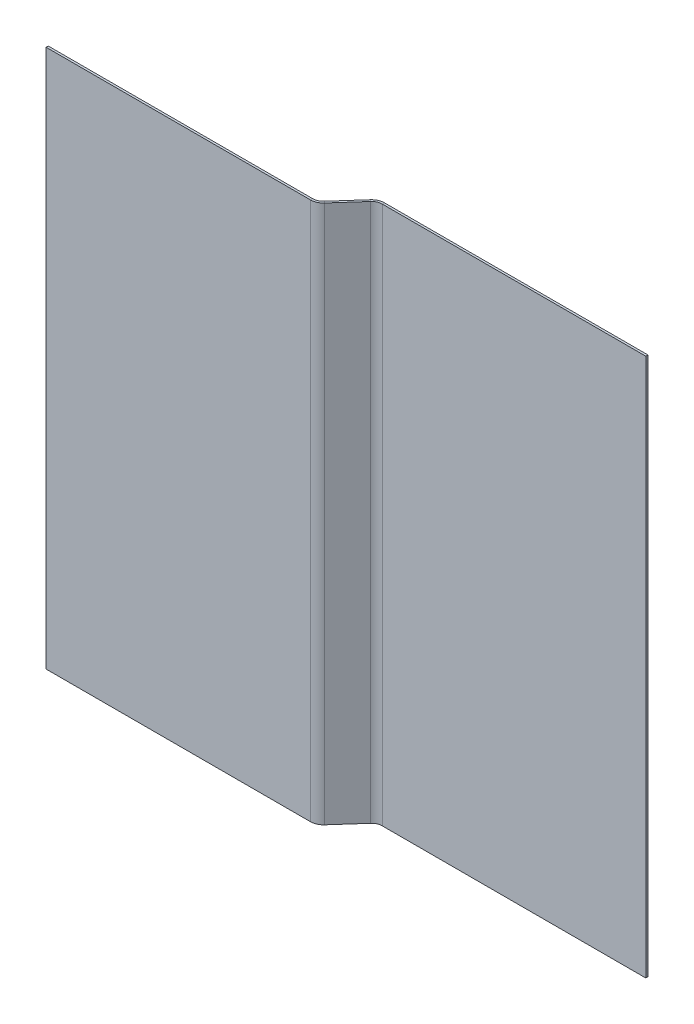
ISO-10303-21;
HEADER;
FILE_DESCRIPTION(('STEP AP214'),'2;1');
FILE_NAME('part.step','',(''),(''),'','','');
FILE_SCHEMA(('AUTOMOTIVE_DESIGN { 1 0 10303 214 1 1 1 1 }'));
ENDSEC;
DATA;
#1=APPLICATION_CONTEXT('core data for automotive mechanical design processes');
#2=APPLICATION_PROTOCOL_DEFINITION('international standard','automotive_design',2000,#1);
#3=PRODUCT_CONTEXT('',#1,'mechanical');
#4=PRODUCT('Part','Part','',(#3));
#5=PRODUCT_RELATED_PRODUCT_CATEGORY('part','',(#4));
#6=PRODUCT_DEFINITION_FORMATION('','',#4);
#7=PRODUCT_DEFINITION_CONTEXT('part definition',#1,'design');
#8=PRODUCT_DEFINITION('design','',#6,#7);
#9=PRODUCT_DEFINITION_SHAPE('','',#8);
#10=(LENGTH_UNIT() NAMED_UNIT(*) SI_UNIT(.MILLI.,.METRE.));
#11=(NAMED_UNIT(*) PLANE_ANGLE_UNIT() SI_UNIT($,.RADIAN.));
#12=(NAMED_UNIT(*) SI_UNIT($,.STERADIAN.) SOLID_ANGLE_UNIT());
#13=UNCERTAINTY_MEASURE_WITH_UNIT(LENGTH_MEASURE(1.E-05),#10,'distance_accuracy_value','');
#14=(GEOMETRIC_REPRESENTATION_CONTEXT(3) GLOBAL_UNCERTAINTY_ASSIGNED_CONTEXT((#13)) GLOBAL_UNIT_ASSIGNED_CONTEXT((#10,
#11,#12)) REPRESENTATION_CONTEXT('',''));
#15=CARTESIAN_POINT('',(0.,0.,0.));
#16=DIRECTION('',(0.,0.,1.));
#17=DIRECTION('',(1.,0.,0.));
#18=AXIS2_PLACEMENT_3D('',#15,#16,#17);
#19=CARTESIAN_POINT('',(-23.7645171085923,500.,-3.34520515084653));
#20=DIRECTION('',(0.,1.,0.));
#21=DIRECTION('',(0.,0.,1.));
#22=AXIS2_PLACEMENT_3D('',#19,#20,#21);
#23=PLANE('',#22);
#24=DIRECTION('',(0.746416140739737,0.,0.665479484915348));
#25=VECTOR('',#24,1.);
#26=CARTESIAN_POINT('',(-23.7645171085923,500.,-3.34520515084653));
#27=LINE('',#26,#25);
#28=CARTESIAN_POINT('',(-23.7645171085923,500.,-3.34520515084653));
#29=VERTEX_POINT('',#28);
#30=CARTESIAN_POINT('',(-22.2716848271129,500.,-2.01424618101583));
#31=VERTEX_POINT('',#30);
#32=EDGE_CURVE('E11',#29,#31,#27,.T.);
#33=ORIENTED_EDGE('',*,*,#32,.F.);
#34=CARTESIAN_POINT('',(-31.2286785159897,500.,-10.));
#35=DIRECTION('',(0.,-1.,0.));
#36=DIRECTION('',(0.,0.,-1.));
#37=AXIS2_PLACEMENT_3D('',#34,#35,#36);
#38=CIRCLE('',#37,10.);
#39=CARTESIAN_POINT('',(-31.2286785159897,500.,0.));
#40=VERTEX_POINT('',#39);
#41=EDGE_CURVE('E243',#40,#29,#38,.F.);
#42=ORIENTED_EDGE('',*,*,#41,.F.);
#43=DIRECTION('',(0.,0.,-1.));
#44=VECTOR('',#43,1.);
#45=CARTESIAN_POINT('',(-31.2286785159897,500.,1.99999999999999));
#46=LINE('',#45,#44);
#47=CARTESIAN_POINT('',(-31.2286785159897,500.,1.99999999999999));
#48=VERTEX_POINT('',#47);
#49=EDGE_CURVE('E41',#48,#40,#46,.T.);
#50=ORIENTED_EDGE('',*,*,#49,.F.);
#51=CARTESIAN_POINT('',(-31.2286785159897,500.,-10.));
#52=DIRECTION('',(0.,1.,0.));
#53=DIRECTION('',(1.,0.,0.));
#54=AXIS2_PLACEMENT_3D('',#51,#52,#53);
#55=CIRCLE('',#54,12.);
#56=EDGE_CURVE('E142',#48,#31,#55,.T.);
#57=ORIENTED_EDGE('',*,*,#56,.T.);
#58=EDGE_LOOP('',(#33,#42,#50,#57));
#59=FACE_BOUND('',#58,.T.);
#60=ADVANCED_FACE('F33',(#59),#23,.T.);
#61=CARTESIAN_POINT('',(-31.2286785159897,500.,1.99999999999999));
#62=DIRECTION('',(0.,1.,0.));
#63=DIRECTION('',(0.,0.,1.));
#64=AXIS2_PLACEMENT_3D('',#61,#62,#63);
#65=PLANE('',#64);
#66=DIRECTION('',(0.665479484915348,0.,-0.746416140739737));
#67=VECTOR('',#66,1.);
#68=CARTESIAN_POINT('',(-26.7469893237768,500.,0.));
#69=LINE('',#68,#67);
#70=CARTESIAN_POINT('',(-3.57896665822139,500.,-25.9857538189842));
#71=VERTEX_POINT('',#70);
#72=EDGE_CURVE('E136',#29,#71,#69,.T.);
#73=ORIENTED_EDGE('',*,*,#72,.F.);
#74=ORIENTED_EDGE('',*,*,#32,.T.);
#75=DIRECTION('',(0.665479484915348,0.,-0.746416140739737));
#76=VECTOR('',#75,1.);
#77=CARTESIAN_POINT('',(-25.2541570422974,500.,1.3309589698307));
#78=LINE('',#77,#76);
#79=CARTESIAN_POINT('',(-2.08613437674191,500.,-24.6547948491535));
#80=VERTEX_POINT('',#79);
#81=EDGE_CURVE('E133',#31,#80,#78,.T.);
#82=ORIENTED_EDGE('',*,*,#81,.T.);
#83=DIRECTION('',(-0.746416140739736,0.,-0.66547948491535));
#84=VECTOR('',#83,1.);
#85=CARTESIAN_POINT('',(-2.08613437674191,500.,-24.6547948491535));
#86=LINE('',#85,#84);
#87=EDGE_CURVE('E224',#80,#71,#86,.T.);
#88=ORIENTED_EDGE('',*,*,#87,.T.);
#89=EDGE_LOOP('',(#73,#74,#82,#88));
#90=FACE_BOUND('',#89,.T.);
#91=ADVANCED_FACE('F131',(#90),#65,.T.);
#92=CARTESIAN_POINT('',(-31.2286785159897,0.,0.));
#93=DIRECTION('',(0.,-1.,0.));
#94=DIRECTION('',(0.,0.,-1.));
#95=AXIS2_PLACEMENT_3D('',#92,#93,#94);
#96=PLANE('',#95);
#97=DIRECTION('',(0.,0.,1.));
#98=VECTOR('',#97,1.);
#99=CARTESIAN_POINT('',(-31.2286785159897,0.,0.));
#100=LINE('',#99,#98);
#101=CARTESIAN_POINT('',(-31.2286785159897,0.,0.));
#102=VERTEX_POINT('',#101);
#103=CARTESIAN_POINT('',(-31.2286785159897,0.,1.99999999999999));
#104=VERTEX_POINT('',#103);
#105=EDGE_CURVE('E229',#102,#104,#100,.T.);
#106=ORIENTED_EDGE('',*,*,#105,.F.);
#107=CARTESIAN_POINT('',(-31.2286785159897,0.,-10.));
#108=DIRECTION('',(0.,-1.,0.));
#109=DIRECTION('',(0.,0.,-1.));
#110=AXIS2_PLACEMENT_3D('',#107,#108,#109);
#111=CIRCLE('',#110,10.);
#112=CARTESIAN_POINT('',(-23.7645171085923,0.,-3.34520515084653));
#113=VERTEX_POINT('',#112);
#114=EDGE_CURVE('E181',#102,#113,#111,.F.);
#115=ORIENTED_EDGE('',*,*,#114,.T.);
#116=DIRECTION('',(-0.746416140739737,0.,-0.665479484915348));
#117=VECTOR('',#116,1.);
#118=CARTESIAN_POINT('',(-22.2716848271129,0.,-2.01424618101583));
#119=LINE('',#118,#117);
#120=CARTESIAN_POINT('',(-22.2716848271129,0.,-2.01424618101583));
#121=VERTEX_POINT('',#120);
#122=EDGE_CURVE('E227',#121,#113,#119,.T.);
#123=ORIENTED_EDGE('',*,*,#122,.F.);
#124=CARTESIAN_POINT('',(-31.2286785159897,0.,-10.));
#125=DIRECTION('',(0.,1.,0.));
#126=DIRECTION('',(1.,0.,0.));
#127=AXIS2_PLACEMENT_3D('',#124,#125,#126);
#128=CIRCLE('',#127,12.);
#129=EDGE_CURVE('E154',#104,#121,#128,.T.);
#130=ORIENTED_EDGE('',*,*,#129,.F.);
#131=EDGE_LOOP('',(#106,#115,#123,#130));
#132=FACE_BOUND('',#131,.T.);
#133=ADVANCED_FACE('F281',(#132),#96,.T.);
#134=CARTESIAN_POINT('',(-22.2716848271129,0.,-2.01424618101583));
#135=DIRECTION('',(0.,-1.,0.));
#136=DIRECTION('',(0.,0.,-1.));
#137=AXIS2_PLACEMENT_3D('',#134,#135,#136);
#138=PLANE('',#137);
#139=DIRECTION('',(1.,0.,0.));
#140=VECTOR('',#139,1.);
#141=CARTESIAN_POINT('',(-276.746989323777,0.,0.));
#142=LINE('',#141,#140);
#143=CARTESIAN_POINT('',(-276.746989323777,0.,0.));
#144=VERTEX_POINT('',#143);
#145=EDGE_CURVE('E184',#144,#102,#142,.T.);
#146=ORIENTED_EDGE('',*,*,#145,.T.);
#147=ORIENTED_EDGE('',*,*,#105,.T.);
#148=DIRECTION('',(1.,0.,0.));
#149=VECTOR('',#148,1.);
#150=CARTESIAN_POINT('',(-276.746989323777,0.,2.));
#151=LINE('',#150,#149);
#152=CARTESIAN_POINT('',(-276.746989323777,0.,2.));
#153=VERTEX_POINT('',#152);
#154=EDGE_CURVE('E190',#153,#104,#151,.T.);
#155=ORIENTED_EDGE('',*,*,#154,.F.);
#156=DIRECTION('',(0.,0.,-1.));
#157=VECTOR('',#156,1.);
#158=CARTESIAN_POINT('',(-276.746989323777,0.,2.));
#159=LINE('',#158,#157);
#160=EDGE_CURVE('E187',#153,#144,#159,.T.);
#161=ORIENTED_EDGE('',*,*,#160,.T.);
#162=EDGE_LOOP('',(#146,#147,#155,#161));
#163=FACE_BOUND('',#162,.T.);
#164=ADVANCED_FACE('F284',(#163),#138,.T.);
#165=CARTESIAN_POINT('',(5.37802703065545,500.,-30.));
#166=DIRECTION('',(0.,1.,0.));
#167=DIRECTION('',(0.,0.,1.));
#168=AXIS2_PLACEMENT_3D('',#165,#166,#167);
#169=PLANE('',#168);
#170=DIRECTION('',(0.,0.,1.));
#171=VECTOR('',#170,1.);
#172=CARTESIAN_POINT('',(5.37802703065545,500.,-30.));
#173=LINE('',#172,#171);
#174=CARTESIAN_POINT('',(5.37802703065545,500.,-30.));
#175=VERTEX_POINT('',#174);
#176=CARTESIAN_POINT('',(5.37802703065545,500.,-28.));
#177=VERTEX_POINT('',#176);
#178=EDGE_CURVE('E49',#175,#177,#173,.T.);
#179=ORIENTED_EDGE('',*,*,#178,.F.);
#180=CARTESIAN_POINT('',(5.37802703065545,500.,-18.));
#181=DIRECTION('',(0.,1.,0.));
#182=DIRECTION('',(0.,0.,1.));
#183=AXIS2_PLACEMENT_3D('',#180,#181,#182);
#184=CIRCLE('',#183,12.);
#185=EDGE_CURVE('E253',#71,#175,#184,.F.);
#186=ORIENTED_EDGE('',*,*,#185,.F.);
#187=ORIENTED_EDGE('',*,*,#87,.F.);
#188=CARTESIAN_POINT('',(5.37802703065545,500.,-18.));
#189=DIRECTION('',(0.,1.,0.));
#190=DIRECTION('',(1.,0.,0.));
#191=AXIS2_PLACEMENT_3D('',#188,#189,#190);
#192=CIRCLE('',#191,10.);
#193=EDGE_CURVE('E162',#80,#177,#192,.F.);
#194=ORIENTED_EDGE('',*,*,#193,.T.);
#195=EDGE_LOOP('',(#179,#186,#187,#194));
#196=FACE_BOUND('',#195,.T.);
#197=ADVANCED_FACE('F276',(#196),#169,.T.);
#198=CARTESIAN_POINT('',(-2.08613437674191,500.,-24.6547948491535));
#199=DIRECTION('',(0.,1.,0.));
#200=DIRECTION('',(0.,0.,1.));
#201=AXIS2_PLACEMENT_3D('',#198,#199,#200);
#202=PLANE('',#201);
#203=DIRECTION('',(1.,0.,0.));
#204=VECTOR('',#203,1.);
#205=CARTESIAN_POINT('',(0.,500.,-30.));
#206=LINE('',#205,#204);
#207=CARTESIAN_POINT('',(250.,500.,-30.));
#208=VERTEX_POINT('',#207);
#209=EDGE_CURVE('E256',#175,#208,#206,.T.);
#210=ORIENTED_EDGE('',*,*,#209,.F.);
#211=ORIENTED_EDGE('',*,*,#178,.T.);
#212=DIRECTION('',(1.,0.,0.));
#213=VECTOR('',#212,1.);
#214=CARTESIAN_POINT('',(0.,500.,-28.));
#215=LINE('',#214,#213);
#216=CARTESIAN_POINT('',(250.,500.,-28.));
#217=VERTEX_POINT('',#216);
#218=EDGE_CURVE('E103',#177,#217,#215,.T.);
#219=ORIENTED_EDGE('',*,*,#218,.T.);
#220=DIRECTION('',(0.,0.,1.));
#221=VECTOR('',#220,1.);
#222=CARTESIAN_POINT('',(250.,500.,-30.));
#223=LINE('',#222,#221);
#224=EDGE_CURVE('E259',#208,#217,#223,.T.);
#225=ORIENTED_EDGE('',*,*,#224,.F.);
#226=EDGE_LOOP('',(#210,#211,#219,#225));
#227=FACE_BOUND('',#226,.T.);
#228=ADVANCED_FACE('F265',(#227),#202,.T.);
#229=CARTESIAN_POINT('',(-3.57896665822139,0.,-25.9857538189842));
#230=DIRECTION('',(0.,-1.,0.));
#231=DIRECTION('',(0.,0.,-1.));
#232=AXIS2_PLACEMENT_3D('',#229,#230,#231);
#233=PLANE('',#232);
#234=DIRECTION('',(0.746416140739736,0.,0.66547948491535));
#235=VECTOR('',#234,1.);
#236=CARTESIAN_POINT('',(-3.57896665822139,0.,-25.9857538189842));
#237=LINE('',#236,#235);
#238=CARTESIAN_POINT('',(-3.57896665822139,0.,-25.9857538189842));
#239=VERTEX_POINT('',#238);
#240=CARTESIAN_POINT('',(-2.08613437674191,0.,-24.6547948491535));
#241=VERTEX_POINT('',#240);
#242=EDGE_CURVE('E90',#239,#241,#237,.T.);
#243=ORIENTED_EDGE('',*,*,#242,.F.);
#244=CARTESIAN_POINT('',(5.37802703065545,0.,-18.));
#245=DIRECTION('',(0.,1.,0.));
#246=DIRECTION('',(0.,0.,1.));
#247=AXIS2_PLACEMENT_3D('',#244,#245,#246);
#248=CIRCLE('',#247,12.);
#249=CARTESIAN_POINT('',(5.37802703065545,0.,-30.));
#250=VERTEX_POINT('',#249);
#251=EDGE_CURVE('E177',#239,#250,#248,.F.);
#252=ORIENTED_EDGE('',*,*,#251,.T.);
#253=DIRECTION('',(0.,0.,-1.));
#254=VECTOR('',#253,1.);
#255=CARTESIAN_POINT('',(5.37802703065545,0.,-28.));
#256=LINE('',#255,#254);
#257=CARTESIAN_POINT('',(5.37802703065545,0.,-28.));
#258=VERTEX_POINT('',#257);
#259=EDGE_CURVE('E97',#258,#250,#256,.T.);
#260=ORIENTED_EDGE('',*,*,#259,.F.);
#261=CARTESIAN_POINT('',(5.37802703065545,0.,-18.));
#262=DIRECTION('',(0.,1.,0.));
#263=DIRECTION('',(1.,0.,0.));
#264=AXIS2_PLACEMENT_3D('',#261,#262,#263);
#265=CIRCLE('',#264,10.);
#266=EDGE_CURVE('E196',#241,#258,#265,.F.);
#267=ORIENTED_EDGE('',*,*,#266,.F.);
#268=EDGE_LOOP('',(#243,#252,#260,#267));
#269=FACE_BOUND('',#268,.T.);
#270=ADVANCED_FACE('F313',(#269),#233,.T.);
#271=CARTESIAN_POINT('',(5.37802703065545,0.,-28.));
#272=DIRECTION('',(0.,-1.,0.));
#273=DIRECTION('',(0.,0.,-1.));
#274=AXIS2_PLACEMENT_3D('',#271,#272,#273);
#275=PLANE('',#274);
#276=DIRECTION('',(0.665479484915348,0.,-0.746416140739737));
#277=VECTOR('',#276,1.);
#278=CARTESIAN_POINT('',(-26.7469893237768,0.,0.));
#279=LINE('',#278,#277);
#280=EDGE_CURVE('E179',#113,#239,#279,.T.);
#281=ORIENTED_EDGE('',*,*,#280,.T.);
#282=ORIENTED_EDGE('',*,*,#242,.T.);
#283=DIRECTION('',(0.665479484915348,0.,-0.746416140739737));
#284=VECTOR('',#283,1.);
#285=CARTESIAN_POINT('',(-25.2541570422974,0.,1.3309589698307));
#286=LINE('',#285,#284);
#287=EDGE_CURVE('E194',#121,#241,#286,.T.);
#288=ORIENTED_EDGE('',*,*,#287,.F.);
#289=ORIENTED_EDGE('',*,*,#122,.T.);
#290=EDGE_LOOP('',(#281,#282,#288,#289));
#291=FACE_BOUND('',#290,.T.);
#292=ADVANCED_FACE('F316',(#291),#275,.T.);
#293=CARTESIAN_POINT('',(0.,500.,-28.));
#294=DIRECTION('',(0.,0.,-1.));
#295=DIRECTION('',(-1.,0.,0.));
#296=AXIS2_PLACEMENT_3D('',#293,#294,#295);
#297=PLANE('',#296);
#298=DIRECTION('',(1.,0.,0.));
#299=VECTOR('',#298,1.);
#300=CARTESIAN_POINT('',(0.,0.,-28.));
#301=LINE('',#300,#299);
#302=CARTESIAN_POINT('',(250.,0.,-28.));
#303=VERTEX_POINT('',#302);
#304=EDGE_CURVE('E168',#258,#303,#301,.T.);
#305=ORIENTED_EDGE('',*,*,#304,.T.);
#306=DIRECTION('',(0.,-1.,0.));
#307=VECTOR('',#306,1.);
#308=CARTESIAN_POINT('',(250.,500.,-28.));
#309=LINE('',#308,#307);
#310=EDGE_CURVE('E220',#217,#303,#309,.T.);
#311=ORIENTED_EDGE('',*,*,#310,.F.);
#312=ORIENTED_EDGE('',*,*,#218,.F.);
#313=DIRECTION('',(0.,-1.,0.));
#314=VECTOR('',#313,1.);
#315=CARTESIAN_POINT('',(5.37802703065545,500.,-28.));
#316=LINE('',#315,#314);
#317=EDGE_CURVE('E164',#177,#258,#316,.T.);
#318=ORIENTED_EDGE('',*,*,#317,.T.);
#319=EDGE_LOOP('',(#305,#311,#312,#318));
#320=FACE_BOUND('',#319,.T.);
#321=ADVANCED_FACE('F319',(#320),#297,.F.);
#322=CARTESIAN_POINT('',(250.,500.,-30.));
#323=DIRECTION('',(1.,0.,0.));
#324=DIRECTION('',(0.,0.,-1.));
#325=AXIS2_PLACEMENT_3D('',#322,#323,#324);
#326=PLANE('',#325);
#327=DIRECTION('',(0.,0.,1.));
#328=VECTOR('',#327,1.);
#329=CARTESIAN_POINT('',(250.,0.,-30.));
#330=LINE('',#329,#328);
#331=CARTESIAN_POINT('',(250.,0.,-30.));
#332=VERTEX_POINT('',#331);
#333=EDGE_CURVE('E171',#332,#303,#330,.T.);
#334=ORIENTED_EDGE('',*,*,#333,.F.);
#335=DIRECTION('',(0.,-1.,0.));
#336=VECTOR('',#335,1.);
#337=CARTESIAN_POINT('',(250.,500.,-30.));
#338=LINE('',#337,#336);
#339=EDGE_CURVE('E218',#208,#332,#338,.T.);
#340=ORIENTED_EDGE('',*,*,#339,.F.);
#341=ORIENTED_EDGE('',*,*,#224,.T.);
#342=ORIENTED_EDGE('',*,*,#310,.T.);
#343=EDGE_LOOP('',(#334,#340,#341,#342));
#344=FACE_BOUND('',#343,.T.);
#345=ADVANCED_FACE('F264',(#344),#326,.T.);
#346=CARTESIAN_POINT('',(0.,500.,-30.));
#347=DIRECTION('',(0.,0.,-1.));
#348=DIRECTION('',(-1.,0.,0.));
#349=AXIS2_PLACEMENT_3D('',#346,#347,#348);
#350=PLANE('',#349);
#351=DIRECTION('',(1.,0.,0.));
#352=VECTOR('',#351,1.);
#353=CARTESIAN_POINT('',(0.,0.,-30.));
#354=LINE('',#353,#352);
#355=EDGE_CURVE('E174',#250,#332,#354,.T.);
#356=ORIENTED_EDGE('',*,*,#355,.F.);
#357=DIRECTION('',(0.,-1.,0.));
#358=VECTOR('',#357,1.);
#359=CARTESIAN_POINT('',(5.37802703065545,500.,-30.));
#360=LINE('',#359,#358);
#361=EDGE_CURVE('E215',#175,#250,#360,.T.);
#362=ORIENTED_EDGE('',*,*,#361,.F.);
#363=ORIENTED_EDGE('',*,*,#209,.T.);
#364=ORIENTED_EDGE('',*,*,#339,.T.);
#365=EDGE_LOOP('',(#356,#362,#363,#364));
#366=FACE_BOUND('',#365,.T.);
#367=ADVANCED_FACE('F269',(#366),#350,.T.);
#368=CARTESIAN_POINT('',(5.37802703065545,500.,-18.));
#369=DIRECTION('',(0.,-1.,0.));
#370=DIRECTION('',(0.,0.,-1.));
#371=AXIS2_PLACEMENT_3D('',#368,#369,#370);
#372=CYLINDRICAL_SURFACE('',#371,12.);
#373=ORIENTED_EDGE('',*,*,#251,.F.);
#374=DIRECTION('',(0.,-1.,0.));
#375=VECTOR('',#374,1.);
#376=CARTESIAN_POINT('',(-3.57896665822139,500.,-25.9857538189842));
#377=LINE('',#376,#375);
#378=EDGE_CURVE('E212',#71,#239,#377,.T.);
#379=ORIENTED_EDGE('',*,*,#378,.F.);
#380=ORIENTED_EDGE('',*,*,#185,.T.);
#381=ORIENTED_EDGE('',*,*,#361,.T.);
#382=EDGE_LOOP('',(#373,#379,#380,#381));
#383=FACE_BOUND('',#382,.T.);
#384=ADVANCED_FACE('F272',(#383),#372,.T.);
#385=CARTESIAN_POINT('',(-26.7469893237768,500.,0.));
#386=DIRECTION('',(-0.746416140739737,0.,-0.665479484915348));
#387=DIRECTION('',(-0.665479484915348,0.,0.746416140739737));
#388=AXIS2_PLACEMENT_3D('',#385,#386,#387);
#389=PLANE('',#388);
#390=ORIENTED_EDGE('',*,*,#280,.F.);
#391=DIRECTION('',(0.,-1.,0.));
#392=VECTOR('',#391,1.);
#393=CARTESIAN_POINT('',(-23.7645171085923,500.,-3.34520515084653));
#394=LINE('',#393,#392);
#395=EDGE_CURVE('E209',#29,#113,#394,.T.);
#396=ORIENTED_EDGE('',*,*,#395,.F.);
#397=ORIENTED_EDGE('',*,*,#72,.T.);
#398=ORIENTED_EDGE('',*,*,#378,.T.);
#399=EDGE_LOOP('',(#390,#396,#397,#398));
#400=FACE_BOUND('',#399,.T.);
#401=ADVANCED_FACE('F279',(#400),#389,.T.);
#402=CARTESIAN_POINT('',(-31.2286785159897,500.,-10.));
#403=DIRECTION('',(0.,-1.,0.));
#404=DIRECTION('',(0.,0.,-1.));
#405=AXIS2_PLACEMENT_3D('',#402,#403,#404);
#406=CYLINDRICAL_SURFACE('',#405,10.);
#407=ORIENTED_EDGE('',*,*,#114,.F.);
#408=DIRECTION('',(0.,-1.,0.));
#409=VECTOR('',#408,1.);
#410=CARTESIAN_POINT('',(-31.2286785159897,500.,0.));
#411=LINE('',#410,#409);
#412=EDGE_CURVE('E206',#40,#102,#411,.T.);
#413=ORIENTED_EDGE('',*,*,#412,.F.);
#414=ORIENTED_EDGE('',*,*,#41,.T.);
#415=ORIENTED_EDGE('',*,*,#395,.T.);
#416=EDGE_LOOP('',(#407,#413,#414,#415));
#417=FACE_BOUND('',#416,.T.);
#418=ADVANCED_FACE('F242',(#417),#406,.F.);
#419=CARTESIAN_POINT('',(-276.746989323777,500.,0.));
#420=DIRECTION('',(0.,0.,-1.));
#421=DIRECTION('',(-1.,0.,0.));
#422=AXIS2_PLACEMENT_3D('',#419,#420,#421);
#423=PLANE('',#422);
#424=ORIENTED_EDGE('',*,*,#145,.F.);
#425=DIRECTION('',(0.,-1.,0.));
#426=VECTOR('',#425,1.);
#427=CARTESIAN_POINT('',(-276.746989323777,500.,0.));
#428=LINE('',#427,#426);
#429=CARTESIAN_POINT('',(-276.746989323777,500.,0.));
#430=VERTEX_POINT('',#429);
#431=EDGE_CURVE('E204',#430,#144,#428,.T.);
#432=ORIENTED_EDGE('',*,*,#431,.F.);
#433=DIRECTION('',(1.,0.,0.));
#434=VECTOR('',#433,1.);
#435=CARTESIAN_POINT('',(-276.746989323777,500.,0.));
#436=LINE('',#435,#434);
#437=EDGE_CURVE('E236',#430,#40,#436,.T.);
#438=ORIENTED_EDGE('',*,*,#437,.T.);
#439=ORIENTED_EDGE('',*,*,#412,.T.);
#440=EDGE_LOOP('',(#424,#432,#438,#439));
#441=FACE_BOUND('',#440,.T.);
#442=ADVANCED_FACE('F247',(#441),#423,.T.);
#443=CARTESIAN_POINT('',(-276.746989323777,500.,2.));
#444=DIRECTION('',(-1.,0.,0.));
#445=DIRECTION('',(0.,0.,1.));
#446=AXIS2_PLACEMENT_3D('',#443,#444,#445);
#447=PLANE('',#446);
#448=ORIENTED_EDGE('',*,*,#160,.F.);
#449=DIRECTION('',(0.,-1.,0.));
#450=VECTOR('',#449,1.);
#451=CARTESIAN_POINT('',(-276.746989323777,500.,2.));
#452=LINE('',#451,#450);
#453=CARTESIAN_POINT('',(-276.746989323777,500.,2.));
#454=VERTEX_POINT('',#453);
#455=EDGE_CURVE('E202',#454,#153,#452,.T.);
#456=ORIENTED_EDGE('',*,*,#455,.F.);
#457=DIRECTION('',(0.,0.,-1.));
#458=VECTOR('',#457,1.);
#459=CARTESIAN_POINT('',(-276.746989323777,500.,2.));
#460=LINE('',#459,#458);
#461=EDGE_CURVE('E248',#454,#430,#460,.T.);
#462=ORIENTED_EDGE('',*,*,#461,.T.);
#463=ORIENTED_EDGE('',*,*,#431,.T.);
#464=EDGE_LOOP('',(#448,#456,#462,#463));
#465=FACE_BOUND('',#464,.T.);
#466=ADVANCED_FACE('F289',(#465),#447,.T.);
#467=CARTESIAN_POINT('',(-276.746989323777,500.,2.));
#468=DIRECTION('',(0.,0.,-1.));
#469=DIRECTION('',(-1.,0.,0.));
#470=AXIS2_PLACEMENT_3D('',#467,#468,#469);
#471=PLANE('',#470);
#472=ORIENTED_EDGE('',*,*,#154,.T.);
#473=DIRECTION('',(0.,-1.,0.));
#474=VECTOR('',#473,1.);
#475=CARTESIAN_POINT('',(-31.2286785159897,500.,1.99999999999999));
#476=LINE('',#475,#474);
#477=EDGE_CURVE('E156',#48,#104,#476,.T.);
#478=ORIENTED_EDGE('',*,*,#477,.F.);
#479=DIRECTION('',(1.,0.,0.));
#480=VECTOR('',#479,1.);
#481=CARTESIAN_POINT('',(-276.746989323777,500.,2.));
#482=LINE('',#481,#480);
#483=EDGE_CURVE('E147',#454,#48,#482,.T.);
#484=ORIENTED_EDGE('',*,*,#483,.F.);
#485=ORIENTED_EDGE('',*,*,#455,.T.);
#486=EDGE_LOOP('',(#472,#478,#484,#485));
#487=FACE_BOUND('',#486,.T.);
#488=ADVANCED_FACE('F287',(#487),#471,.F.);
#489=CARTESIAN_POINT('',(-31.2286785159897,500.,-10.));
#490=DIRECTION('',(0.,-1.,0.));
#491=DIRECTION('',(0.,0.,-1.));
#492=AXIS2_PLACEMENT_3D('',#489,#490,#491);
#493=CYLINDRICAL_SURFACE('',#492,12.);
#494=ORIENTED_EDGE('',*,*,#129,.T.);
#495=DIRECTION('',(0.,-1.,0.));
#496=VECTOR('',#495,1.);
#497=CARTESIAN_POINT('',(-22.2716848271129,500.,-2.01424618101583));
#498=LINE('',#497,#496);
#499=EDGE_CURVE('E151',#31,#121,#498,.T.);
#500=ORIENTED_EDGE('',*,*,#499,.F.);
#501=ORIENTED_EDGE('',*,*,#56,.F.);
#502=ORIENTED_EDGE('',*,*,#477,.T.);
#503=EDGE_LOOP('',(#494,#500,#501,#502));
#504=FACE_BOUND('',#503,.T.);
#505=ADVANCED_FACE('F152',(#504),#493,.T.);
#506=CARTESIAN_POINT('',(-25.2541570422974,500.,1.3309589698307));
#507=DIRECTION('',(-0.746416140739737,0.,-0.665479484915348));
#508=DIRECTION('',(-0.665479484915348,0.,0.746416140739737));
#509=AXIS2_PLACEMENT_3D('',#506,#507,#508);
#510=PLANE('',#509);
#511=ORIENTED_EDGE('',*,*,#287,.T.);
#512=DIRECTION('',(0.,-1.,0.));
#513=VECTOR('',#512,1.);
#514=CARTESIAN_POINT('',(-2.08613437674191,500.,-24.6547948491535));
#515=LINE('',#514,#513);
#516=EDGE_CURVE('E157',#80,#241,#515,.T.);
#517=ORIENTED_EDGE('',*,*,#516,.F.);
#518=ORIENTED_EDGE('',*,*,#81,.F.);
#519=ORIENTED_EDGE('',*,*,#499,.T.);
#520=EDGE_LOOP('',(#511,#517,#518,#519));
#521=FACE_BOUND('',#520,.T.);
#522=ADVANCED_FACE('F159',(#521),#510,.F.);
#523=CARTESIAN_POINT('',(5.37802703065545,500.,-18.));
#524=DIRECTION('',(0.,-1.,0.));
#525=DIRECTION('',(0.,0.,-1.));
#526=AXIS2_PLACEMENT_3D('',#523,#524,#525);
#527=CYLINDRICAL_SURFACE('',#526,10.);
#528=ORIENTED_EDGE('',*,*,#266,.T.);
#529=ORIENTED_EDGE('',*,*,#317,.F.);
#530=ORIENTED_EDGE('',*,*,#193,.F.);
#531=ORIENTED_EDGE('',*,*,#516,.T.);
#532=EDGE_LOOP('',(#528,#529,#530,#531));
#533=FACE_BOUND('',#532,.T.);
#534=ADVANCED_FACE('F371',(#533),#527,.F.);
#535=CARTESIAN_POINT('',(5.37802703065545,500.,-18.));
#536=DIRECTION('',(0.,1.,0.));
#537=DIRECTION('',(0.,0.,1.));
#538=AXIS2_PLACEMENT_3D('',#535,#536,#537);
#539=PLANE('',#538);
#540=ORIENTED_EDGE('',*,*,#483,.T.);
#541=ORIENTED_EDGE('',*,*,#49,.T.);
#542=ORIENTED_EDGE('',*,*,#437,.F.);
#543=ORIENTED_EDGE('',*,*,#461,.F.);
#544=EDGE_LOOP('',(#540,#541,#542,#543));
#545=FACE_BOUND('',#544,.T.);
#546=ADVANCED_FACE('F233',(#545),#539,.T.);
#547=CARTESIAN_POINT('',(5.37802703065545,0.,-18.));
#548=DIRECTION('',(0.,1.,0.));
#549=DIRECTION('',(0.,0.,1.));
#550=AXIS2_PLACEMENT_3D('',#547,#548,#549);
#551=PLANE('',#550);
#552=ORIENTED_EDGE('',*,*,#304,.F.);
#553=ORIENTED_EDGE('',*,*,#259,.T.);
#554=ORIENTED_EDGE('',*,*,#355,.T.);
#555=ORIENTED_EDGE('',*,*,#333,.T.);
#556=EDGE_LOOP('',(#552,#553,#554,#555));
#557=FACE_BOUND('',#556,.T.);
#558=ADVANCED_FACE('F391',(#557),#551,.F.);
#559=CLOSED_SHELL('',(#60,#91,#133,#164,#197,#228,#270,#292,#321,#345,#367,#384,#401,#418,#442,
#466,#488,#505,#522,#534,#546,#558));
#560=MANIFOLD_SOLID_BREP('B2',#559);
#561=ADVANCED_BREP_SHAPE_REPRESENTATION('',(#18,#560),#14);
#562=SHAPE_DEFINITION_REPRESENTATION(#9,#561);
ENDSEC;
END-ISO-10303-21;
